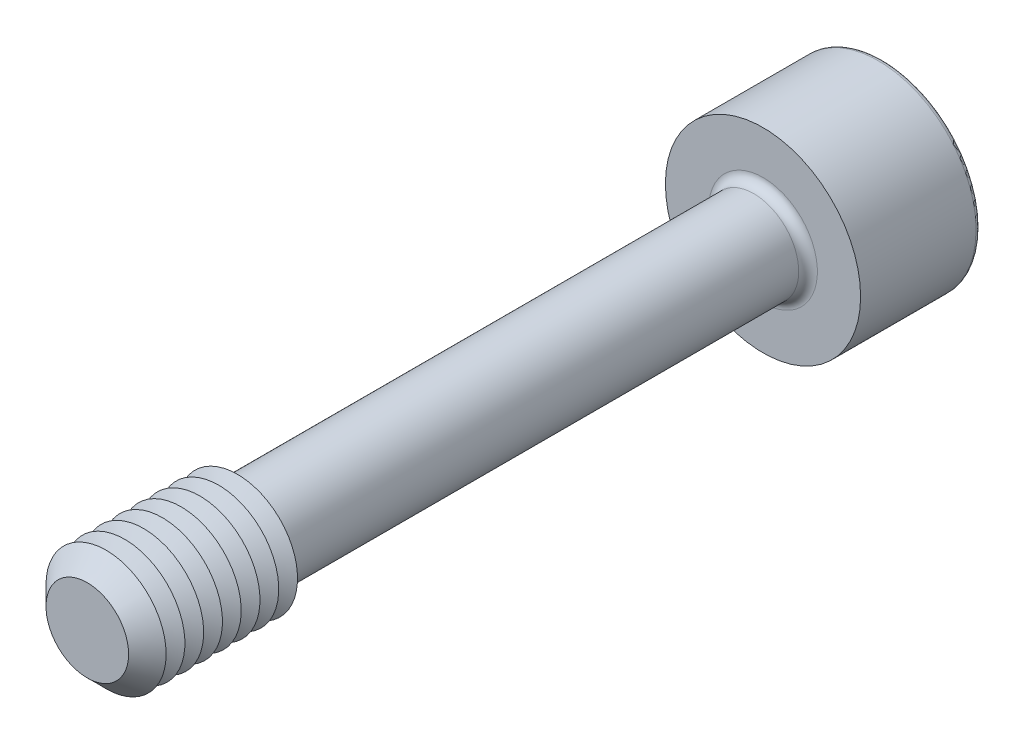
from build123d import *

# Parameters (mm, degrees)
SKETCH1_R       = 3
EXTRUDE1_DEPTH  = 22.5
CHAMFER1_SIZE   = 1.25
SKETCH3_R       = 6.5
EXTRUDE2_DEPTH  = 8
EXTRUDE3_DEPTH  = 6
FILLET1_R       = 0.62
FILLET2_R       = 0.31
LPATTERN1_COUNT = 7
LPATTERN1_PITCH = 1.25


with BuildPart() as part:
    # Sketch1 → Extrude1 (new, symmetric)
    with BuildSketch(Plane.XY):
        with Locations(Location((0, 0, 0), (0, 0, 180))):
            Circle(SKETCH1_R)
    extrude(amount=EXTRUDE1_DEPTH, both=True)

    # Sketch2 → Revolve1 (revolve)
    with BuildSketch(Plane(origin=(0, 0, 0), x_dir=(0, 0, -1), z_dir=(1, 0, 0)), mode=Mode.PRIVATE) as revolve1_sk:
        Polygon((-22.5, 0), (-22.5, 4), (-12.5, 4), (-11.922649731, 3), (-11.922649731, 0), align=None)
    revolve(revolve1_sk.sketch.rotate(Axis((0, 0, 11.922649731), (0, 0, 1)), 90), axis=Axis((0, 0, 11.922649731), (0, 0, 1)))

    # Chamfer1
    chamfer1_edges = [part.edges().sort_by_distance(p)[0] for p in [
        (4, 0, 22.5),
    ]]
    chamfer(chamfer1_edges, length=CHAMFER1_SIZE)

    # Sketch3 → Extrude2 (add)
    with BuildSketch(Plane(origin=(0, 0, -22.5), x_dir=(-1, 0, 0), z_dir=(0, 0, -1))):
        Circle(SKETCH3_R)
    extrude(amount=EXTRUDE2_DEPTH)

    # Sketch4 → Extrude3 (cut)
    with BuildSketch(Plane(origin=(-13.7, 0, -30.5), x_dir=(1, 0, 0), z_dir=(0, 0, 1))):
        Polygon((11.967949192, -3), (15.432050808, -3), (17.164101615, 0), (15.432050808, 3), (11.967949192, 3), (10.235898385, 0), align=None)
    extrude(amount=EXTRUDE3_DEPTH, mode=Mode.SUBTRACT)

    # Fillet1
    fillet1_edges = [part.edges().sort_by_distance(p)[0] for p in [
        (3, 0, -22.5),
    ]]
    fillet(fillet1_edges, radius=FILLET1_R)

    # Fillet2
    fillet2_edges = [part.edges().sort_by_distance(p)[0] for p in [
        (6.5, 0, -30.5),
    ]]
    fillet(fillet2_edges, radius=FILLET2_R)

    # Sketch5 → Cut-Revolve1 (revolve, cut)
    with BuildSketch(Plane(origin=(0, 0, 0), x_dir=(0, 0, -1), z_dir=(1, 0, 0)), mode=Mode.PRIVATE) as cut_revolve1_sk:
        Polygon((24.5, 0), (24.5, -3), (22.767949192, 0), align=None)
    revolve(cut_revolve1_sk.sketch.rotate(Axis((0, 0, -22.767949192), (0, 0, -1)), 180), axis=Axis((0, 0, -22.767949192), (0, 0, -1)), mode=Mode.SUBTRACT)

    # Sketch7 → Cut-Revolve2 (revolve, cut)
    with BuildSketch(Plane(origin=(0, 0, 0), x_dir=(0, 0, -1), z_dir=(1, 0, 0)), mode=Mode.PRIVATE) as cut_revolve2_sk:
        Polygon((-12.5, 4), (-13.125, 2.917468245), (-13.75, 4), align=None)
    cut_revolve2 = revolve(cut_revolve2_sk.sketch.rotate(Axis((0, 0, -1.332048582), (0, 0, 1)), 90), axis=Axis((0, 0, -1.332048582), (0, 0, 1)), mode=Mode.SUBTRACT)

    # LPattern1: Cut-Revolve2 ×7
    with Locations(*[(0, 0, i * LPATTERN1_PITCH) for i in range(1, LPATTERN1_COUNT)]):
        add(cut_revolve2, mode=Mode.SUBTRACT)


solid = part.part
